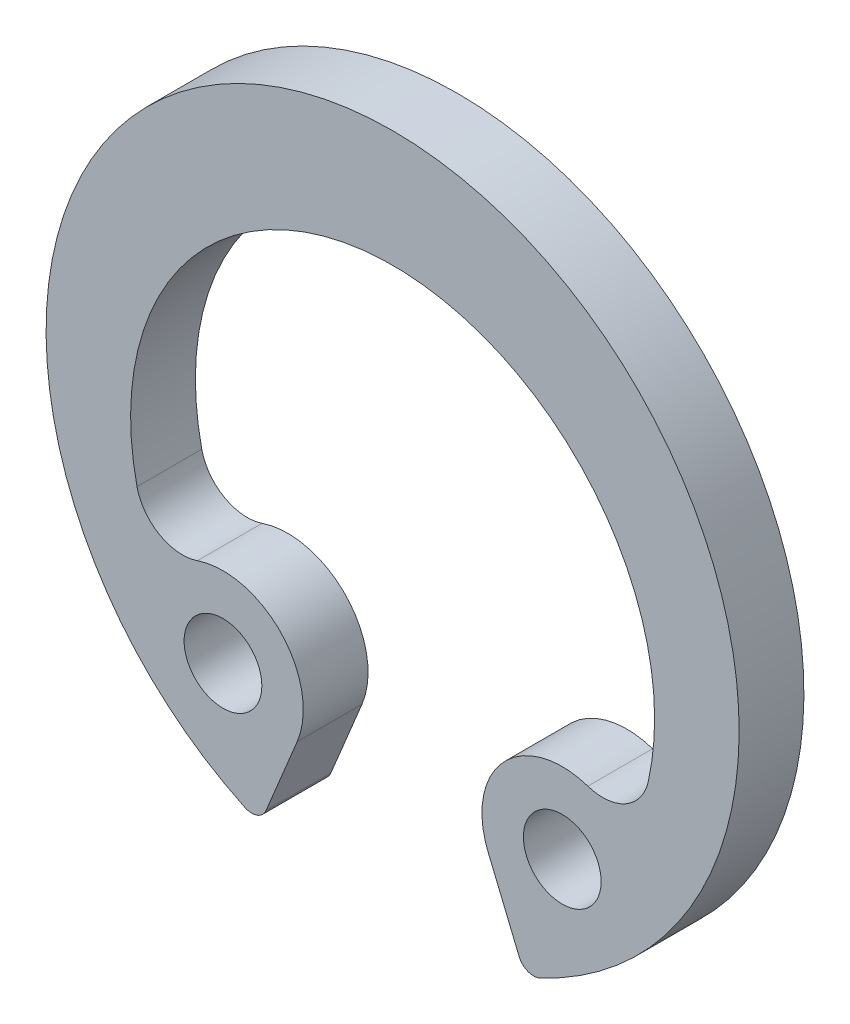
ISO-10303-21;
HEADER;
FILE_DESCRIPTION(('STEP AP214'),'2;1');
FILE_NAME('part.step','',(''),(''),'','','');
FILE_SCHEMA(('AUTOMOTIVE_DESIGN { 1 0 10303 214 1 1 1 1 }'));
ENDSEC;
DATA;
#1=APPLICATION_CONTEXT('core data for automotive mechanical design processes');
#2=APPLICATION_PROTOCOL_DEFINITION('international standard','automotive_design',2000,#1);
#3=PRODUCT_CONTEXT('',#1,'mechanical');
#4=PRODUCT('Part','Part','',(#3));
#5=PRODUCT_RELATED_PRODUCT_CATEGORY('part','',(#4));
#6=PRODUCT_DEFINITION_FORMATION('','',#4);
#7=PRODUCT_DEFINITION_CONTEXT('part definition',#1,'design');
#8=PRODUCT_DEFINITION('design','',#6,#7);
#9=PRODUCT_DEFINITION_SHAPE('','',#8);
#10=(LENGTH_UNIT() NAMED_UNIT(*) SI_UNIT(.MILLI.,.METRE.));
#11=(NAMED_UNIT(*) PLANE_ANGLE_UNIT() SI_UNIT($,.RADIAN.));
#12=(NAMED_UNIT(*) SI_UNIT($,.STERADIAN.) SOLID_ANGLE_UNIT());
#13=UNCERTAINTY_MEASURE_WITH_UNIT(LENGTH_MEASURE(1.E-05),#10,'distance_accuracy_value','');
#14=(GEOMETRIC_REPRESENTATION_CONTEXT(3) GLOBAL_UNCERTAINTY_ASSIGNED_CONTEXT((#13)) GLOBAL_UNIT_ASSIGNED_CONTEXT((#10,
#11,#12)) REPRESENTATION_CONTEXT('',''));
#15=CARTESIAN_POINT('',(0.,0.,0.));
#16=DIRECTION('',(0.,0.,1.));
#17=DIRECTION('',(1.,0.,0.));
#18=AXIS2_PLACEMENT_3D('',#15,#16,#17);
#19=CARTESIAN_POINT('',(-2.61898232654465,-3.08268658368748,1.));
#20=DIRECTION('',(0.,0.,-1.));
#21=DIRECTION('',(-1.,0.,0.));
#22=AXIS2_PLACEMENT_3D('',#19,#20,#21);
#23=CYLINDRICAL_SURFACE('',#22,1.23993108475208);
#24=CARTESIAN_POINT('',(-2.61898232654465,-3.08268658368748,0.));
#25=DIRECTION('',(0.,0.,1.));
#26=DIRECTION('',(1.,0.,0.));
#27=AXIS2_PLACEMENT_3D('',#24,#25,#26);
#28=CIRCLE('',#27,1.23993108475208);
#29=CARTESIAN_POINT('',(-3.01430880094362,-1.90746487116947,0.));
#30=VERTEX_POINT('',#29);
#31=CARTESIAN_POINT('',(-1.47343537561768,-3.55718766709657,0.));
#32=VERTEX_POINT('',#31);
#33=EDGE_CURVE('E157',#30,#32,#28,.F.);
#34=ORIENTED_EDGE('',*,*,#33,.F.);
#35=DIRECTION('',(0.,0.,-1.));
#36=VECTOR('',#35,1.);
#37=CARTESIAN_POINT('',(-3.01430880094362,-1.90746487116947,1.));
#38=LINE('',#37,#36);
#39=CARTESIAN_POINT('',(-3.01430880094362,-1.90746487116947,1.));
#40=VERTEX_POINT('',#39);
#41=EDGE_CURVE('E186',#30,#40,#38,.F.);
#42=ORIENTED_EDGE('',*,*,#41,.T.);
#43=CARTESIAN_POINT('',(-2.61898232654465,-3.08268658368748,1.));
#44=DIRECTION('',(0.,0.,1.));
#45=DIRECTION('',(1.,0.,0.));
#46=AXIS2_PLACEMENT_3D('',#43,#44,#45);
#47=CIRCLE('',#46,1.23993108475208);
#48=CARTESIAN_POINT('',(-1.47343537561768,-3.55718766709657,1.));
#49=VERTEX_POINT('',#48);
#50=EDGE_CURVE('E177',#40,#49,#47,.F.);
#51=ORIENTED_EDGE('',*,*,#50,.T.);
#52=DIRECTION('',(0.,0.,-1.));
#53=VECTOR('',#52,1.);
#54=CARTESIAN_POINT('',(-1.47343537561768,-3.55718766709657,1.));
#55=LINE('',#54,#53);
#56=EDGE_CURVE('E141',#49,#32,#55,.T.);
#57=ORIENTED_EDGE('',*,*,#56,.T.);
#58=EDGE_LOOP('',(#34,#42,#51,#57));
#59=FACE_BOUND('',#58,.T.);
#60=ADVANCED_FACE('F41',(#59),#23,.T.);
#61=CARTESIAN_POINT('',(0.,-0.495,1.));
#62=DIRECTION('',(0.,0.,-1.));
#63=DIRECTION('',(-1.,0.,0.));
#64=AXIS2_PLACEMENT_3D('',#61,#62,#63);
#65=CYLINDRICAL_SURFACE('',#64,4.045);
#66=CARTESIAN_POINT('',(0.,-0.495,0.));
#67=DIRECTION('',(0.,0.,1.));
#68=DIRECTION('',(1.,0.,0.));
#69=AXIS2_PLACEMENT_3D('',#66,#67,#68);
#70=CIRCLE('',#69,4.045);
#71=CARTESIAN_POINT('',(-3.94629708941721,-1.38312402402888,0.));
#72=VERTEX_POINT('',#71);
#73=CARTESIAN_POINT('',(3.94629708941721,-1.38312402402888,0.));
#74=VERTEX_POINT('',#73);
#75=EDGE_CURVE('E159',#72,#74,#70,.F.);
#76=ORIENTED_EDGE('',*,*,#75,.T.);
#77=DIRECTION('',(0.,0.,-1.));
#78=VECTOR('',#77,1.);
#79=CARTESIAN_POINT('',(3.94629708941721,-1.38312402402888,1.));
#80=LINE('',#79,#78);
#81=CARTESIAN_POINT('',(3.94629708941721,-1.38312402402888,1.));
#82=VERTEX_POINT('',#81);
#83=EDGE_CURVE('E184',#74,#82,#80,.F.);
#84=ORIENTED_EDGE('',*,*,#83,.T.);
#85=CARTESIAN_POINT('',(0.,-0.495,1.));
#86=DIRECTION('',(0.,0.,1.));
#87=DIRECTION('',(1.,0.,0.));
#88=AXIS2_PLACEMENT_3D('',#85,#86,#87);
#89=CIRCLE('',#88,4.045);
#90=CARTESIAN_POINT('',(-3.94629708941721,-1.38312402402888,1.));
#91=VERTEX_POINT('',#90);
#92=EDGE_CURVE('E132',#91,#82,#89,.F.);
#93=ORIENTED_EDGE('',*,*,#92,.F.);
#94=DIRECTION('',(0.,0.,-1.));
#95=VECTOR('',#94,1.);
#96=CARTESIAN_POINT('',(-3.94629708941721,-1.38312402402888,1.));
#97=LINE('',#96,#95);
#98=EDGE_CURVE('E181',#91,#72,#97,.T.);
#99=ORIENTED_EDGE('',*,*,#98,.T.);
#100=EDGE_LOOP('',(#76,#84,#93,#99));
#101=FACE_BOUND('',#100,.T.);
#102=ADVANCED_FACE('F234',(#101),#65,.F.);
#103=CARTESIAN_POINT('',(2.61898232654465,-3.08268658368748,1.));
#104=DIRECTION('',(0.,0.,-1.));
#105=DIRECTION('',(-1.,0.,0.));
#106=AXIS2_PLACEMENT_3D('',#103,#104,#105);
#107=CYLINDRICAL_SURFACE('',#106,1.23993108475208);
#108=CARTESIAN_POINT('',(2.61898232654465,-3.08268658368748,1.));
#109=DIRECTION('',(0.,0.,1.));
#110=DIRECTION('',(1.,0.,0.));
#111=AXIS2_PLACEMENT_3D('',#108,#109,#110);
#112=CIRCLE('',#111,1.23993108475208);
#113=CARTESIAN_POINT('',(3.01430880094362,-1.90746487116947,1.));
#114=VERTEX_POINT('',#113);
#115=CARTESIAN_POINT('',(1.47343537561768,-3.55718766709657,1.));
#116=VERTEX_POINT('',#115);
#117=EDGE_CURVE('E120',#114,#116,#112,.T.);
#118=ORIENTED_EDGE('',*,*,#117,.F.);
#119=DIRECTION('',(0.,0.,-1.));
#120=VECTOR('',#119,1.);
#121=CARTESIAN_POINT('',(3.01430880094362,-1.90746487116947,1.));
#122=LINE('',#121,#120);
#123=CARTESIAN_POINT('',(3.01430880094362,-1.90746487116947,0.));
#124=VERTEX_POINT('',#123);
#125=EDGE_CURVE('E140',#114,#124,#122,.T.);
#126=ORIENTED_EDGE('',*,*,#125,.T.);
#127=CARTESIAN_POINT('',(2.61898232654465,-3.08268658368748,0.));
#128=DIRECTION('',(0.,0.,1.));
#129=DIRECTION('',(1.,0.,0.));
#130=AXIS2_PLACEMENT_3D('',#127,#128,#129);
#131=CIRCLE('',#130,1.23993108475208);
#132=CARTESIAN_POINT('',(1.47343537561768,-3.55718766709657,0.));
#133=VERTEX_POINT('',#132);
#134=EDGE_CURVE('E138',#124,#133,#131,.T.);
#135=ORIENTED_EDGE('',*,*,#134,.T.);
#136=DIRECTION('',(0.,0.,-1.));
#137=VECTOR('',#136,1.);
#138=CARTESIAN_POINT('',(1.47343537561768,-3.55718766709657,1.));
#139=LINE('',#138,#137);
#140=EDGE_CURVE('E135',#116,#133,#139,.T.);
#141=ORIENTED_EDGE('',*,*,#140,.F.);
#142=EDGE_LOOP('',(#118,#126,#135,#141));
#143=FACE_BOUND('',#142,.T.);
#144=ADVANCED_FACE('F136',(#143),#107,.T.);
#145=CARTESIAN_POINT('',(0.,0.,1.));
#146=DIRECTION('',(0.923879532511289,0.382683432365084,0.));
#147=DIRECTION('',(-0.382683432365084,0.923879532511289,0.));
#148=AXIS2_PLACEMENT_3D('',#145,#146,#147);
#149=PLANE('',#148);
#150=DIRECTION('',(0.382683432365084,-0.923879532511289,0.));
#151=VECTOR('',#150,1.);
#152=CARTESIAN_POINT('',(0.,0.,0.));
#153=LINE('',#152,#151);
#154=CARTESIAN_POINT('',(1.95335434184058,-4.71581454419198,0.));
#155=VERTEX_POINT('',#154);
#156=EDGE_CURVE('E163',#133,#155,#153,.T.);
#157=ORIENTED_EDGE('',*,*,#156,.T.);
#158=DIRECTION('',(0.,0.,-1.));
#159=VECTOR('',#158,1.);
#160=CARTESIAN_POINT('',(1.95335434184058,-4.71581454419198,1.));
#161=LINE('',#160,#159);
#162=CARTESIAN_POINT('',(1.95335434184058,-4.71581454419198,1.));
#163=VERTEX_POINT('',#162);
#164=EDGE_CURVE('E64',#155,#163,#161,.F.);
#165=ORIENTED_EDGE('',*,*,#164,.T.);
#166=DIRECTION('',(0.382683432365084,-0.923879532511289,0.));
#167=VECTOR('',#166,1.);
#168=CARTESIAN_POINT('',(0.,0.,1.));
#169=LINE('',#168,#167);
#170=EDGE_CURVE('E124',#116,#163,#169,.T.);
#171=ORIENTED_EDGE('',*,*,#170,.F.);
#172=ORIENTED_EDGE('',*,*,#140,.T.);
#173=EDGE_LOOP('',(#157,#165,#171,#172));
#174=FACE_BOUND('',#173,.T.);
#175=ADVANCED_FACE('F143',(#174),#149,.F.);
#176=CARTESIAN_POINT('',(0.,0.,1.));
#177=DIRECTION('',(0.,0.,-1.));
#178=DIRECTION('',(-1.,0.,0.));
#179=AXIS2_PLACEMENT_3D('',#176,#177,#178);
#180=CYLINDRICAL_SURFACE('',#179,5.35);
#181=CARTESIAN_POINT('',(0.,0.,1.));
#182=DIRECTION('',(0.,0.,1.));
#183=DIRECTION('',(1.,0.,0.));
#184=AXIS2_PLACEMENT_3D('',#181,#182,#183);
#185=CIRCLE('',#184,5.35);
#186=CARTESIAN_POINT('',(2.27724208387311,-4.84114330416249,1.));
#187=VERTEX_POINT('',#186);
#188=CARTESIAN_POINT('',(-2.27724208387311,-4.84114330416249,1.));
#189=VERTEX_POINT('',#188);
#190=EDGE_CURVE('E144',#187,#189,#185,.T.);
#191=ORIENTED_EDGE('',*,*,#190,.F.);
#192=DIRECTION('',(0.,0.,-1.));
#193=VECTOR('',#192,1.);
#194=CARTESIAN_POINT('',(2.27724208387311,-4.84114330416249,1.));
#195=LINE('',#194,#193);
#196=CARTESIAN_POINT('',(2.27724208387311,-4.84114330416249,0.));
#197=VERTEX_POINT('',#196);
#198=EDGE_CURVE('E197',#187,#197,#195,.T.);
#199=ORIENTED_EDGE('',*,*,#198,.T.);
#200=CARTESIAN_POINT('',(0.,0.,0.));
#201=DIRECTION('',(0.,0.,1.));
#202=DIRECTION('',(1.,0.,0.));
#203=AXIS2_PLACEMENT_3D('',#200,#201,#202);
#204=CIRCLE('',#203,5.35);
#205=CARTESIAN_POINT('',(-2.27724208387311,-4.84114330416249,0.));
#206=VERTEX_POINT('',#205);
#207=EDGE_CURVE('E165',#197,#206,#204,.T.);
#208=ORIENTED_EDGE('',*,*,#207,.T.);
#209=DIRECTION('',(0.,0.,-1.));
#210=VECTOR('',#209,1.);
#211=CARTESIAN_POINT('',(-2.27724208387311,-4.84114330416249,1.));
#212=LINE('',#211,#210);
#213=EDGE_CURVE('E195',#206,#189,#212,.F.);
#214=ORIENTED_EDGE('',*,*,#213,.T.);
#215=EDGE_LOOP('',(#191,#199,#208,#214));
#216=FACE_BOUND('',#215,.T.);
#217=ADVANCED_FACE('F209',(#216),#180,.T.);
#218=CARTESIAN_POINT('',(2.61898232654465,-3.08268658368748,1.));
#219=DIRECTION('',(0.,0.,-1.));
#220=DIRECTION('',(-1.,0.,0.));
#221=AXIS2_PLACEMENT_3D('',#218,#219,#220);
#222=CYLINDRICAL_SURFACE('',#221,0.599999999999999);
#223=CARTESIAN_POINT('',(2.61898232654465,-3.08268658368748,1.));
#224=DIRECTION('',(0.,0.,1.));
#225=DIRECTION('',(1.,0.,0.));
#226=AXIS2_PLACEMENT_3D('',#223,#224,#225);
#227=CIRCLE('',#226,0.599999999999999);
#228=CARTESIAN_POINT('',(3.21898232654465,-3.08268658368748,1.));
#229=VERTEX_POINT('',#228);
#230=EDGE_CURVE('E151',#229,#229,#227,.T.);
#231=ORIENTED_EDGE('',*,*,#230,.T.);
#232=EDGE_LOOP('',(#231));
#233=FACE_BOUND('',#232,.T.);
#234=CARTESIAN_POINT('',(2.61898232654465,-3.08268658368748,0.));
#235=DIRECTION('',(0.,0.,1.));
#236=DIRECTION('',(1.,0.,0.));
#237=AXIS2_PLACEMENT_3D('',#234,#235,#236);
#238=CIRCLE('',#237,0.599999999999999);
#239=CARTESIAN_POINT('',(3.21898232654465,-3.08268658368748,0.));
#240=VERTEX_POINT('',#239);
#241=EDGE_CURVE('E171',#240,#240,#238,.T.);
#242=ORIENTED_EDGE('',*,*,#241,.F.);
#243=EDGE_LOOP('',(#242));
#244=FACE_BOUND('',#243,.T.);
#245=ADVANCED_FACE('F260',(#233,#244),#222,.F.);
#246=CARTESIAN_POINT('',(0.,0.,1.));
#247=DIRECTION('',(0.923879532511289,-0.382683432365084,0.));
#248=DIRECTION('',(0.382683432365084,0.923879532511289,0.));
#249=AXIS2_PLACEMENT_3D('',#246,#247,#248);
#250=PLANE('',#249);
#251=DIRECTION('',(-0.382683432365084,-0.923879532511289,0.));
#252=VECTOR('',#251,1.);
#253=CARTESIAN_POINT('',(0.,0.,1.));
#254=LINE('',#253,#252);
#255=CARTESIAN_POINT('',(-1.95335434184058,-4.71581454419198,1.));
#256=VERTEX_POINT('',#255);
#257=EDGE_CURVE('E146',#49,#256,#254,.T.);
#258=ORIENTED_EDGE('',*,*,#257,.T.);
#259=DIRECTION('',(0.,0.,1.));
#260=VECTOR('',#259,1.);
#261=CARTESIAN_POINT('',(-1.95335434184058,-4.71581454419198,0.));
#262=LINE('',#261,#260);
#263=CARTESIAN_POINT('',(-1.95335434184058,-4.71581454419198,0.));
#264=VERTEX_POINT('',#263);
#265=EDGE_CURVE('E11',#256,#264,#262,.F.);
#266=ORIENTED_EDGE('',*,*,#265,.T.);
#267=DIRECTION('',(-0.382683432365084,-0.923879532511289,0.));
#268=VECTOR('',#267,1.);
#269=CARTESIAN_POINT('',(0.,0.,0.));
#270=LINE('',#269,#268);
#271=EDGE_CURVE('E168',#32,#264,#270,.T.);
#272=ORIENTED_EDGE('',*,*,#271,.F.);
#273=ORIENTED_EDGE('',*,*,#56,.F.);
#274=EDGE_LOOP('',(#258,#266,#272,#273));
#275=FACE_BOUND('',#274,.T.);
#276=ADVANCED_FACE('F220',(#275),#250,.T.);
#277=CARTESIAN_POINT('',(-2.61898232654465,-3.08268658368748,1.));
#278=DIRECTION('',(0.,0.,-1.));
#279=DIRECTION('',(-1.,0.,0.));
#280=AXIS2_PLACEMENT_3D('',#277,#278,#279);
#281=CYLINDRICAL_SURFACE('',#280,0.599999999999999);
#282=CARTESIAN_POINT('',(-2.61898232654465,-3.08268658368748,1.));
#283=DIRECTION('',(0.,0.,1.));
#284=DIRECTION('',(1.,0.,0.));
#285=AXIS2_PLACEMENT_3D('',#282,#283,#284);
#286=CIRCLE('',#285,0.599999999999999);
#287=CARTESIAN_POINT('',(-2.01898232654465,-3.08268658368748,1.));
#288=VERTEX_POINT('',#287);
#289=EDGE_CURVE('E154',#288,#288,#286,.F.);
#290=ORIENTED_EDGE('',*,*,#289,.F.);
#291=EDGE_LOOP('',(#290));
#292=FACE_BOUND('',#291,.T.);
#293=CARTESIAN_POINT('',(-2.61898232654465,-3.08268658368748,0.));
#294=DIRECTION('',(0.,0.,1.));
#295=DIRECTION('',(1.,0.,0.));
#296=AXIS2_PLACEMENT_3D('',#293,#294,#295);
#297=CIRCLE('',#296,0.599999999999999);
#298=CARTESIAN_POINT('',(-2.01898232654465,-3.08268658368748,0.));
#299=VERTEX_POINT('',#298);
#300=EDGE_CURVE('E174',#299,#299,#297,.F.);
#301=ORIENTED_EDGE('',*,*,#300,.T.);
#302=EDGE_LOOP('',(#301));
#303=FACE_BOUND('',#302,.T.);
#304=ADVANCED_FACE('F263',(#292,#303),#281,.F.);
#305=CARTESIAN_POINT('',(0.,0.,1.));
#306=DIRECTION('',(0.,0.,1.));
#307=DIRECTION('',(1.,0.,0.));
#308=AXIS2_PLACEMENT_3D('',#305,#306,#307);
#309=PLANE('',#308);
#310=ORIENTED_EDGE('',*,*,#170,.T.);
#311=CARTESIAN_POINT('',(2.17508542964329,-4.62397052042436,1.));
#312=DIRECTION('',(0.,0.,1.));
#313=DIRECTION('',(1.,0.,0.));
#314=AXIS2_PLACEMENT_3D('',#311,#312,#313);
#315=CIRCLE('',#314,0.24);
#316=EDGE_CURVE('E49',#163,#187,#315,.T.);
#317=ORIENTED_EDGE('',*,*,#316,.T.);
#318=ORIENTED_EDGE('',*,*,#190,.T.);
#319=CARTESIAN_POINT('',(-2.17508542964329,-4.62397052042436,1.));
#320=DIRECTION('',(0.,0.,1.));
#321=DIRECTION('',(1.,0.,0.));
#322=AXIS2_PLACEMENT_3D('',#319,#320,#321);
#323=CIRCLE('',#322,0.24);
#324=EDGE_CURVE('E56',#189,#256,#323,.T.);
#325=ORIENTED_EDGE('',*,*,#324,.T.);
#326=ORIENTED_EDGE('',*,*,#257,.F.);
#327=ORIENTED_EDGE('',*,*,#50,.F.);
#328=CARTESIAN_POINT('',(-3.24386596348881,-1.22504014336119,1.));
#329=DIRECTION('',(0.,0.,1.));
#330=DIRECTION('',(1.,0.,0.));
#331=AXIS2_PLACEMENT_3D('',#328,#329,#330);
#332=CIRCLE('',#331,0.72);
#333=EDGE_CURVE('E193',#40,#91,#332,.F.);
#334=ORIENTED_EDGE('',*,*,#333,.T.);
#335=ORIENTED_EDGE('',*,*,#92,.T.);
#336=CARTESIAN_POINT('',(3.24386596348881,-1.22504014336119,1.));
#337=DIRECTION('',(0.,0.,1.));
#338=DIRECTION('',(1.,0.,0.));
#339=AXIS2_PLACEMENT_3D('',#336,#337,#338);
#340=CIRCLE('',#339,0.72);
#341=EDGE_CURVE('E128',#82,#114,#340,.F.);
#342=ORIENTED_EDGE('',*,*,#341,.T.);
#343=ORIENTED_EDGE('',*,*,#117,.T.);
#344=EDGE_LOOP('',(#310,#317,#318,#325,#326,#327,#334,#335,#342,#343));
#345=FACE_BOUND('',#344,.T.);
#346=ORIENTED_EDGE('',*,*,#230,.F.);
#347=EDGE_LOOP('',(#346));
#348=FACE_BOUND('',#347,.T.);
#349=ORIENTED_EDGE('',*,*,#289,.T.);
#350=EDGE_LOOP('',(#349));
#351=FACE_BOUND('',#350,.T.);
#352=ADVANCED_FACE('F122',(#345,#348,#351),#309,.T.);
#353=CARTESIAN_POINT('',(0.,0.,0.));
#354=DIRECTION('',(0.,0.,1.));
#355=DIRECTION('',(1.,0.,0.));
#356=AXIS2_PLACEMENT_3D('',#353,#354,#355);
#357=PLANE('',#356);
#358=ORIENTED_EDGE('',*,*,#207,.F.);
#359=CARTESIAN_POINT('',(2.17508542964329,-4.62397052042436,0.));
#360=DIRECTION('',(0.,0.,1.));
#361=DIRECTION('',(1.,0.,0.));
#362=AXIS2_PLACEMENT_3D('',#359,#360,#361);
#363=CIRCLE('',#362,0.24);
#364=EDGE_CURVE('E202',#197,#155,#363,.F.);
#365=ORIENTED_EDGE('',*,*,#364,.T.);
#366=ORIENTED_EDGE('',*,*,#156,.F.);
#367=ORIENTED_EDGE('',*,*,#134,.F.);
#368=CARTESIAN_POINT('',(3.24386596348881,-1.22504014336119,0.));
#369=DIRECTION('',(0.,0.,1.));
#370=DIRECTION('',(1.,0.,0.));
#371=AXIS2_PLACEMENT_3D('',#368,#369,#370);
#372=CIRCLE('',#371,0.72);
#373=EDGE_CURVE('E188',#124,#74,#372,.T.);
#374=ORIENTED_EDGE('',*,*,#373,.T.);
#375=ORIENTED_EDGE('',*,*,#75,.F.);
#376=CARTESIAN_POINT('',(-3.24386596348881,-1.22504014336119,0.));
#377=DIRECTION('',(0.,0.,1.));
#378=DIRECTION('',(1.,0.,0.));
#379=AXIS2_PLACEMENT_3D('',#376,#377,#378);
#380=CIRCLE('',#379,0.72);
#381=EDGE_CURVE('E191',#72,#30,#380,.T.);
#382=ORIENTED_EDGE('',*,*,#381,.T.);
#383=ORIENTED_EDGE('',*,*,#33,.T.);
#384=ORIENTED_EDGE('',*,*,#271,.T.);
#385=CARTESIAN_POINT('',(-2.17508542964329,-4.62397052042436,0.));
#386=DIRECTION('',(0.,0.,1.));
#387=DIRECTION('',(1.,0.,0.));
#388=AXIS2_PLACEMENT_3D('',#385,#386,#387);
#389=CIRCLE('',#388,0.24);
#390=EDGE_CURVE('E200',#264,#206,#389,.F.);
#391=ORIENTED_EDGE('',*,*,#390,.T.);
#392=EDGE_LOOP('',(#358,#365,#366,#367,#374,#375,#382,#383,#384,#391));
#393=FACE_BOUND('',#392,.T.);
#394=ORIENTED_EDGE('',*,*,#241,.T.);
#395=EDGE_LOOP('',(#394));
#396=FACE_BOUND('',#395,.T.);
#397=ORIENTED_EDGE('',*,*,#300,.F.);
#398=EDGE_LOOP('',(#397));
#399=FACE_BOUND('',#398,.T.);
#400=ADVANCED_FACE('F214',(#393,#396,#399),#357,.F.);
#401=CARTESIAN_POINT('',(3.24386596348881,-1.22504014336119,1.));
#402=DIRECTION('',(0.,0.,-1.));
#403=DIRECTION('',(-1.,0.,0.));
#404=AXIS2_PLACEMENT_3D('',#401,#402,#403);
#405=CYLINDRICAL_SURFACE('',#404,0.72);
#406=ORIENTED_EDGE('',*,*,#341,.F.);
#407=ORIENTED_EDGE('',*,*,#83,.F.);
#408=ORIENTED_EDGE('',*,*,#373,.F.);
#409=ORIENTED_EDGE('',*,*,#125,.F.);
#410=EDGE_LOOP('',(#406,#407,#408,#409));
#411=FACE_BOUND('',#410,.T.);
#412=ADVANCED_FACE('F237',(#411),#405,.F.);
#413=CARTESIAN_POINT('',(-3.24386596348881,-1.22504014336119,1.));
#414=DIRECTION('',(0.,0.,-1.));
#415=DIRECTION('',(-1.,0.,0.));
#416=AXIS2_PLACEMENT_3D('',#413,#414,#415);
#417=CYLINDRICAL_SURFACE('',#416,0.72);
#418=ORIENTED_EDGE('',*,*,#333,.F.);
#419=ORIENTED_EDGE('',*,*,#41,.F.);
#420=ORIENTED_EDGE('',*,*,#381,.F.);
#421=ORIENTED_EDGE('',*,*,#98,.F.);
#422=EDGE_LOOP('',(#418,#419,#420,#421));
#423=FACE_BOUND('',#422,.T.);
#424=ADVANCED_FACE('F232',(#423),#417,.F.);
#425=CARTESIAN_POINT('',(2.17508542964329,-4.62397052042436,1.));
#426=DIRECTION('',(0.,0.,-1.));
#427=DIRECTION('',(-1.,0.,0.));
#428=AXIS2_PLACEMENT_3D('',#425,#426,#427);
#429=CYLINDRICAL_SURFACE('',#428,0.24);
#430=ORIENTED_EDGE('',*,*,#316,.F.);
#431=ORIENTED_EDGE('',*,*,#164,.F.);
#432=ORIENTED_EDGE('',*,*,#364,.F.);
#433=ORIENTED_EDGE('',*,*,#198,.F.);
#434=EDGE_LOOP('',(#430,#431,#432,#433));
#435=FACE_BOUND('',#434,.T.);
#436=ADVANCED_FACE('F212',(#435),#429,.T.);
#437=CARTESIAN_POINT('',(-2.17508542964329,-4.62397052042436,1.));
#438=DIRECTION('',(0.,0.,-1.));
#439=DIRECTION('',(-1.,0.,0.));
#440=AXIS2_PLACEMENT_3D('',#437,#438,#439);
#441=CYLINDRICAL_SURFACE('',#440,0.24);
#442=ORIENTED_EDGE('',*,*,#324,.F.);
#443=ORIENTED_EDGE('',*,*,#213,.F.);
#444=ORIENTED_EDGE('',*,*,#390,.F.);
#445=ORIENTED_EDGE('',*,*,#265,.F.);
#446=EDGE_LOOP('',(#442,#443,#444,#445));
#447=FACE_BOUND('',#446,.T.);
#448=ADVANCED_FACE('F43',(#447),#441,.T.);
#449=CLOSED_SHELL('',(#60,#102,#144,#175,#217,#245,#276,#304,#352,#400,#412,#424,#436,#448));
#450=MANIFOLD_SOLID_BREP('B2',#449);
#451=ADVANCED_BREP_SHAPE_REPRESENTATION('',(#18,#450),#14);
#452=SHAPE_DEFINITION_REPRESENTATION(#9,#451);
ENDSEC;
END-ISO-10303-21;
